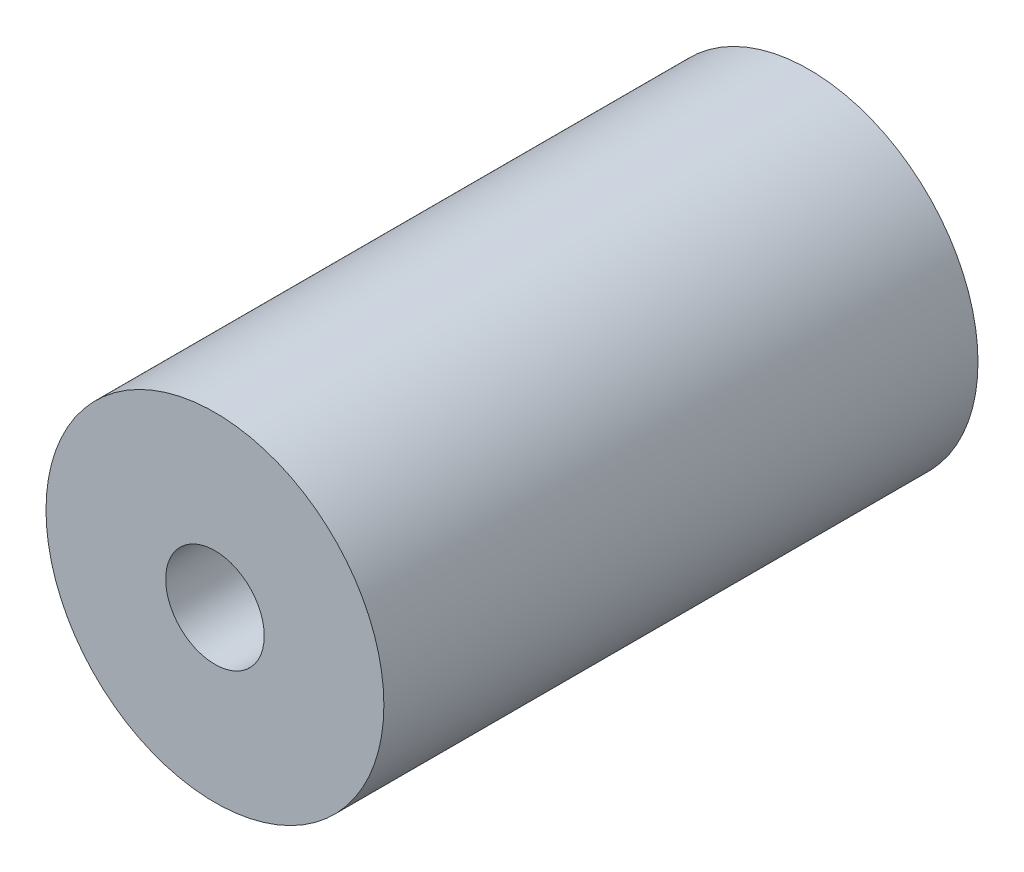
ISO-10303-21;
HEADER;
FILE_DESCRIPTION(('STEP AP214'),'2;1');
FILE_NAME('part.step','',(''),(''),'','','');
FILE_SCHEMA(('AUTOMOTIVE_DESIGN { 1 0 10303 214 1 1 1 1 }'));
ENDSEC;
DATA;
#1=APPLICATION_CONTEXT('core data for automotive mechanical design processes');
#2=APPLICATION_PROTOCOL_DEFINITION('international standard','automotive_design',2000,#1);
#3=PRODUCT_CONTEXT('',#1,'mechanical');
#4=PRODUCT('Part','Part','',(#3));
#5=PRODUCT_RELATED_PRODUCT_CATEGORY('part','',(#4));
#6=PRODUCT_DEFINITION_FORMATION('','',#4);
#7=PRODUCT_DEFINITION_CONTEXT('part definition',#1,'design');
#8=PRODUCT_DEFINITION('design','',#6,#7);
#9=PRODUCT_DEFINITION_SHAPE('','',#8);
#10=(LENGTH_UNIT() NAMED_UNIT(*) SI_UNIT(.MILLI.,.METRE.));
#11=(NAMED_UNIT(*) PLANE_ANGLE_UNIT() SI_UNIT($,.RADIAN.));
#12=(NAMED_UNIT(*) SI_UNIT($,.STERADIAN.) SOLID_ANGLE_UNIT());
#13=UNCERTAINTY_MEASURE_WITH_UNIT(LENGTH_MEASURE(1.E-05),#10,'distance_accuracy_value','');
#14=(GEOMETRIC_REPRESENTATION_CONTEXT(3) GLOBAL_UNCERTAINTY_ASSIGNED_CONTEXT((#13)) GLOBAL_UNIT_ASSIGNED_CONTEXT((#10,
#11,#12)) REPRESENTATION_CONTEXT('',''));
#15=CARTESIAN_POINT('',(0.,0.,0.));
#16=DIRECTION('',(0.,0.,1.));
#17=DIRECTION('',(1.,0.,0.));
#18=AXIS2_PLACEMENT_3D('',#15,#16,#17);
#19=CARTESIAN_POINT('',(0.,0.,21.1));
#20=DIRECTION('',(0.,0.,1.));
#21=DIRECTION('',(1.,0.,0.));
#22=AXIS2_PLACEMENT_3D('',#19,#20,#21);
#23=PLANE('',#22);
#24=CARTESIAN_POINT('',(0.,0.,21.1));
#25=DIRECTION('',(0.,0.,1.));
#26=DIRECTION('',(1.,0.,0.));
#27=AXIS2_PLACEMENT_3D('',#24,#25,#26);
#28=CIRCLE('',#27,6.);
#29=CARTESIAN_POINT('',(6.,0.,21.1));
#30=VERTEX_POINT('',#29);
#31=EDGE_CURVE('E10',#30,#30,#28,.T.);
#32=ORIENTED_EDGE('',*,*,#31,.T.);
#33=EDGE_LOOP('',(#32));
#34=FACE_BOUND('',#33,.T.);
#35=CARTESIAN_POINT('',(0.,0.,21.1));
#36=DIRECTION('',(0.,0.,1.));
#37=DIRECTION('',(1.,0.,0.));
#38=AXIS2_PLACEMENT_3D('',#35,#36,#37);
#39=CIRCLE('',#38,1.75);
#40=CARTESIAN_POINT('',(1.75,0.,21.1));
#41=VERTEX_POINT('',#40);
#42=EDGE_CURVE('E42',#41,#41,#39,.T.);
#43=ORIENTED_EDGE('',*,*,#42,.F.);
#44=EDGE_LOOP('',(#43));
#45=FACE_BOUND('',#44,.T.);
#46=ADVANCED_FACE('F31',(#34,#45),#23,.T.);
#47=CARTESIAN_POINT('',(0.,0.,0.));
#48=DIRECTION('',(0.,0.,1.));
#49=DIRECTION('',(1.,0.,0.));
#50=AXIS2_PLACEMENT_3D('',#47,#48,#49);
#51=PLANE('',#50);
#52=CARTESIAN_POINT('',(0.,0.,0.));
#53=DIRECTION('',(0.,0.,1.));
#54=DIRECTION('',(1.,0.,0.));
#55=AXIS2_PLACEMENT_3D('',#52,#53,#54);
#56=CIRCLE('',#55,6.);
#57=CARTESIAN_POINT('',(6.,0.,0.));
#58=VERTEX_POINT('',#57);
#59=EDGE_CURVE('E35',#58,#58,#56,.T.);
#60=ORIENTED_EDGE('',*,*,#59,.F.);
#61=EDGE_LOOP('',(#60));
#62=FACE_BOUND('',#61,.T.);
#63=CARTESIAN_POINT('',(0.,0.,0.));
#64=DIRECTION('',(0.,0.,1.));
#65=DIRECTION('',(1.,0.,0.));
#66=AXIS2_PLACEMENT_3D('',#63,#64,#65);
#67=CIRCLE('',#66,1.75);
#68=CARTESIAN_POINT('',(1.75,0.,0.));
#69=VERTEX_POINT('',#68);
#70=EDGE_CURVE('E44',#69,#69,#67,.T.);
#71=ORIENTED_EDGE('',*,*,#70,.T.);
#72=EDGE_LOOP('',(#71));
#73=FACE_BOUND('',#72,.T.);
#74=ADVANCED_FACE('F54',(#62,#73),#51,.F.);
#75=CARTESIAN_POINT('',(0.,0.,21.1));
#76=DIRECTION('',(0.,0.,-1.));
#77=DIRECTION('',(-1.,0.,0.));
#78=AXIS2_PLACEMENT_3D('',#75,#76,#77);
#79=CYLINDRICAL_SURFACE('',#78,6.);
#80=ORIENTED_EDGE('',*,*,#31,.F.);
#81=EDGE_LOOP('',(#80));
#82=FACE_BOUND('',#81,.T.);
#83=ORIENTED_EDGE('',*,*,#59,.T.);
#84=EDGE_LOOP('',(#83));
#85=FACE_BOUND('',#84,.T.);
#86=ADVANCED_FACE('F33',(#82,#85),#79,.T.);
#87=CARTESIAN_POINT('',(0.,0.,21.1));
#88=DIRECTION('',(0.,0.,-1.));
#89=DIRECTION('',(-1.,0.,0.));
#90=AXIS2_PLACEMENT_3D('',#87,#88,#89);
#91=CYLINDRICAL_SURFACE('',#90,1.75);
#92=ORIENTED_EDGE('',*,*,#42,.T.);
#93=EDGE_LOOP('',(#92));
#94=FACE_BOUND('',#93,.T.);
#95=ORIENTED_EDGE('',*,*,#70,.F.);
#96=EDGE_LOOP('',(#95));
#97=FACE_BOUND('',#96,.T.);
#98=ADVANCED_FACE('F50',(#94,#97),#91,.F.);
#99=CLOSED_SHELL('',(#46,#74,#86,#98));
#100=MANIFOLD_SOLID_BREP('B2',#99);
#101=ADVANCED_BREP_SHAPE_REPRESENTATION('',(#18,#100),#14);
#102=SHAPE_DEFINITION_REPRESENTATION(#9,#101);
ENDSEC;
END-ISO-10303-21;
